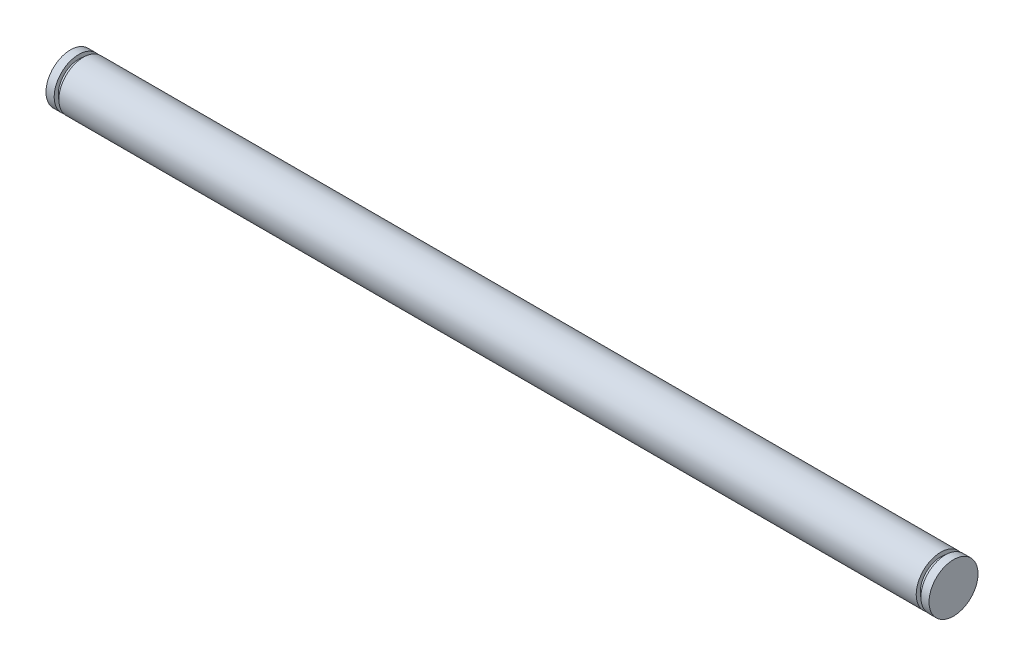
ISO-10303-21;
HEADER;
FILE_DESCRIPTION(('STEP AP214'),'2;1');
FILE_NAME('part.step','',(''),(''),'','','');
FILE_SCHEMA(('AUTOMOTIVE_DESIGN { 1 0 10303 214 1 1 1 1 }'));
ENDSEC;
DATA;
#1=APPLICATION_CONTEXT('core data for automotive mechanical design processes');
#2=APPLICATION_PROTOCOL_DEFINITION('international standard','automotive_design',2000,#1);
#3=PRODUCT_CONTEXT('',#1,'mechanical');
#4=PRODUCT('Part','Part','',(#3));
#5=PRODUCT_RELATED_PRODUCT_CATEGORY('part','',(#4));
#6=PRODUCT_DEFINITION_FORMATION('','',#4);
#7=PRODUCT_DEFINITION_CONTEXT('part definition',#1,'design');
#8=PRODUCT_DEFINITION('design','',#6,#7);
#9=PRODUCT_DEFINITION_SHAPE('','',#8);
#10=(LENGTH_UNIT() NAMED_UNIT(*) SI_UNIT(.MILLI.,.METRE.));
#11=(NAMED_UNIT(*) PLANE_ANGLE_UNIT() SI_UNIT($,.RADIAN.));
#12=(NAMED_UNIT(*) SI_UNIT($,.STERADIAN.) SOLID_ANGLE_UNIT());
#13=UNCERTAINTY_MEASURE_WITH_UNIT(LENGTH_MEASURE(1.E-05),#10,'distance_accuracy_value','');
#14=(GEOMETRIC_REPRESENTATION_CONTEXT(3) GLOBAL_UNCERTAINTY_ASSIGNED_CONTEXT((#13)) GLOBAL_UNIT_ASSIGNED_CONTEXT((#10,
#11,#12)) REPRESENTATION_CONTEXT('',''));
#15=CARTESIAN_POINT('',(0.,0.,0.));
#16=DIRECTION('',(0.,0.,1.));
#17=DIRECTION('',(1.,0.,0.));
#18=AXIS2_PLACEMENT_3D('',#15,#16,#17);
#19=CARTESIAN_POINT('',(216.3,0.,0.));
#20=DIRECTION('',(-1.,0.,0.));
#21=DIRECTION('',(0.,0.,1.));
#22=AXIS2_PLACEMENT_3D('',#19,#20,#21);
#23=CYLINDRICAL_SURFACE('',#22,6.);
#24=CARTESIAN_POINT('',(3.15000000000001,0.,0.));
#25=DIRECTION('',(1.,0.,0.));
#26=DIRECTION('',(0.,0.,-1.));
#27=AXIS2_PLACEMENT_3D('',#24,#25,#26);
#28=CIRCLE('',#27,6.);
#29=CARTESIAN_POINT('',(3.14999999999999,0.,6.));
#30=VERTEX_POINT('',#29);
#31=EDGE_CURVE('E43',#30,#30,#28,.T.);
#32=CARTESIAN_POINT('',(213.15,0.,0.));
#33=DIRECTION('',(1.,0.,0.));
#34=DIRECTION('',(0.,0.,-1.));
#35=AXIS2_PLACEMENT_3D('',#32,#33,#34);
#36=CIRCLE('',#35,6.);
#37=CARTESIAN_POINT('',(213.15,0.,6.));
#38=VERTEX_POINT('',#37);
#39=EDGE_CURVE('E34',#38,#38,#36,.T.);
#40=CARTESIAN_POINT('',(3.14999999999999,0.,6.));
#41=CARTESIAN_POINT('',(5.33749999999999,0.,6.));
#42=CARTESIAN_POINT('',(7.52499999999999,0.,6.));
#43=CARTESIAN_POINT('',(11.9,0.,6.));
#44=CARTESIAN_POINT('',(14.0875,0.,6.));
#45=CARTESIAN_POINT('',(18.4625,0.,6.));
#46=CARTESIAN_POINT('',(20.65,0.,6.));
#47=CARTESIAN_POINT('',(25.025,0.,6.));
#48=CARTESIAN_POINT('',(27.2125,0.,6.));
#49=CARTESIAN_POINT('',(31.5875,0.,6.));
#50=CARTESIAN_POINT('',(33.775,0.,6.));
#51=CARTESIAN_POINT('',(38.15,0.,6.));
#52=CARTESIAN_POINT('',(40.3375,0.,6.));
#53=CARTESIAN_POINT('',(44.7125,0.,6.));
#54=CARTESIAN_POINT('',(46.9,0.,6.));
#55=CARTESIAN_POINT('',(51.275,0.,6.));
#56=CARTESIAN_POINT('',(53.4625,0.,6.));
#57=CARTESIAN_POINT('',(57.8375,0.,6.));
#58=CARTESIAN_POINT('',(60.025,0.,6.));
#59=CARTESIAN_POINT('',(64.4,0.,6.));
#60=CARTESIAN_POINT('',(66.5875,0.,6.));
#61=CARTESIAN_POINT('',(70.9625,0.,6.));
#62=CARTESIAN_POINT('',(73.15,0.,6.));
#63=CARTESIAN_POINT('',(77.525,0.,6.));
#64=CARTESIAN_POINT('',(79.7125,0.,6.));
#65=CARTESIAN_POINT('',(84.0875,0.,6.));
#66=CARTESIAN_POINT('',(86.275,0.,6.));
#67=CARTESIAN_POINT('',(90.65,0.,6.));
#68=CARTESIAN_POINT('',(92.8375,0.,6.));
#69=CARTESIAN_POINT('',(97.2125,0.,6.));
#70=CARTESIAN_POINT('',(99.4,0.,6.));
#71=CARTESIAN_POINT('',(103.775,0.,6.));
#72=CARTESIAN_POINT('',(105.9625,0.,6.));
#73=CARTESIAN_POINT('',(110.3375,0.,6.));
#74=CARTESIAN_POINT('',(112.525,0.,6.));
#75=CARTESIAN_POINT('',(116.9,0.,6.));
#76=CARTESIAN_POINT('',(119.0875,0.,6.));
#77=CARTESIAN_POINT('',(123.4625,0.,6.));
#78=CARTESIAN_POINT('',(125.65,0.,6.));
#79=CARTESIAN_POINT('',(130.025,0.,6.));
#80=CARTESIAN_POINT('',(132.2125,0.,6.));
#81=CARTESIAN_POINT('',(136.5875,0.,6.));
#82=CARTESIAN_POINT('',(138.775,0.,6.));
#83=CARTESIAN_POINT('',(143.15,0.,6.));
#84=CARTESIAN_POINT('',(145.3375,0.,6.));
#85=CARTESIAN_POINT('',(149.7125,0.,6.));
#86=CARTESIAN_POINT('',(151.9,0.,6.));
#87=CARTESIAN_POINT('',(156.275,0.,6.));
#88=CARTESIAN_POINT('',(158.4625,0.,6.));
#89=CARTESIAN_POINT('',(162.8375,0.,6.));
#90=CARTESIAN_POINT('',(165.025,0.,6.));
#91=CARTESIAN_POINT('',(169.4,0.,6.));
#92=CARTESIAN_POINT('',(171.5875,0.,6.));
#93=CARTESIAN_POINT('',(175.9625,0.,6.));
#94=CARTESIAN_POINT('',(178.15,0.,6.));
#95=CARTESIAN_POINT('',(182.525,0.,6.));
#96=CARTESIAN_POINT('',(184.7125,0.,6.));
#97=CARTESIAN_POINT('',(189.0875,0.,6.));
#98=CARTESIAN_POINT('',(191.275,0.,6.));
#99=CARTESIAN_POINT('',(195.65,0.,6.));
#100=CARTESIAN_POINT('',(197.8375,0.,6.));
#101=CARTESIAN_POINT('',(202.2125,0.,6.));
#102=CARTESIAN_POINT('',(204.4,0.,6.));
#103=CARTESIAN_POINT('',(208.775,0.,6.));
#104=CARTESIAN_POINT('',(210.9625,0.,6.));
#105=CARTESIAN_POINT('',(213.15,0.,6.));
#106=B_SPLINE_CURVE_WITH_KNOTS('',3,(#40,#41,#42,#43,#44,#45,#46,#47,#48,#49,#50,#51,#52,#53,
#54,#55,#56,#57,#58,#59,#60,#61,#62,#63,#64,#65,#66,#67,#68,#69,#70,#71,#72,#73,#74,#75,#76,#77,
#78,#79,#80,#81,#82,#83,#84,#85,#86,#87,#88,#89,#90,#91,#92,#93,#94,#95,#96,#97,#98,#99,#100,
#101,#102,#103,#104,#105),.UNSPECIFIED.,.F.,.F.,(4,2,2,2,2,2,2,2,2,2,2,2,2,2,2,2,2,2,2,2,2,2,2,
2,2,2,2,2,2,2,2,2,4),(0.,6.5625,13.125,19.6875,26.25,32.8125,39.375,45.9375,52.5,59.0625,65.625,
72.1875,78.75,85.3125,91.875,98.4375,105.,111.5625,118.125,124.6875,131.25,137.8125,144.375,
150.9375,157.5,164.0625,170.625,177.1875,183.75,190.3125,196.875,203.4375,210.),.UNSPECIFIED.);
#107=EDGE_CURVE('BSEAM30',#30,#38,#106,.T.);
#108=ORIENTED_EDGE('',*,*,#31,.T.);
#109=ORIENTED_EDGE('',*,*,#39,.F.);
#110=ORIENTED_EDGE('',*,*,#107,.T.);
#111=ORIENTED_EDGE('',*,*,#107,.F.);
#112=EDGE_LOOP('',(#108,#110,#109,#111));
#113=FACE_BOUND('',#112,.T.);
#114=ADVANCED_FACE('F30',(#113),#23,.T.);
#115=CARTESIAN_POINT('',(3.15,0.,0.));
#116=DIRECTION('',(1.,0.,0.));
#117=DIRECTION('',(0.,0.,-1.));
#118=AXIS2_PLACEMENT_3D('',#115,#116,#117);
#119=PLANE('',#118);
#120=CARTESIAN_POINT('',(3.15,0.,0.));
#121=DIRECTION('',(1.,0.,0.));
#122=DIRECTION('',(0.,0.,-1.));
#123=AXIS2_PLACEMENT_3D('',#120,#121,#122);
#124=CIRCLE('',#123,5.);
#125=CARTESIAN_POINT('',(3.15,0.,-5.));
#126=VERTEX_POINT('',#125);
#127=EDGE_CURVE('E52',#126,#126,#124,.T.);
#128=ORIENTED_EDGE('',*,*,#127,.T.);
#129=EDGE_LOOP('',(#128));
#130=FACE_BOUND('',#129,.T.);
#131=ORIENTED_EDGE('',*,*,#31,.F.);
#132=EDGE_LOOP('',(#131));
#133=FACE_BOUND('',#132,.T.);
#134=ADVANCED_FACE('F78',(#130,#133),#119,.F.);
#135=CARTESIAN_POINT('',(2.,0.,0.));
#136=DIRECTION('',(1.,0.,0.));
#137=DIRECTION('',(0.,0.,-1.));
#138=AXIS2_PLACEMENT_3D('',#135,#136,#137);
#139=PLANE('',#138);
#140=CARTESIAN_POINT('',(2.,0.,0.));
#141=DIRECTION('',(1.,0.,0.));
#142=DIRECTION('',(0.,0.,-1.));
#143=AXIS2_PLACEMENT_3D('',#140,#141,#142);
#144=CIRCLE('',#143,5.);
#145=CARTESIAN_POINT('',(2.,0.,-5.));
#146=VERTEX_POINT('',#145);
#147=EDGE_CURVE('E46',#146,#146,#144,.T.);
#148=ORIENTED_EDGE('',*,*,#147,.F.);
#149=EDGE_LOOP('',(#148));
#150=FACE_BOUND('',#149,.T.);
#151=CARTESIAN_POINT('',(2.,0.,0.));
#152=DIRECTION('',(1.,0.,0.));
#153=DIRECTION('',(0.,0.,-1.));
#154=AXIS2_PLACEMENT_3D('',#151,#152,#153);
#155=CIRCLE('',#154,6.);
#156=CARTESIAN_POINT('',(2.,0.,6.));
#157=VERTEX_POINT('',#156);
#158=EDGE_CURVE('E49',#157,#157,#155,.T.);
#159=ORIENTED_EDGE('',*,*,#158,.T.);
#160=EDGE_LOOP('',(#159));
#161=FACE_BOUND('',#160,.T.);
#162=ADVANCED_FACE('F75',(#150,#161),#139,.T.);
#163=CARTESIAN_POINT('',(3.15,0.,0.));
#164=DIRECTION('',(-1.,0.,0.));
#165=DIRECTION('',(0.,0.,1.));
#166=AXIS2_PLACEMENT_3D('',#163,#164,#165);
#167=CYLINDRICAL_SURFACE('',#166,5.);
#168=ORIENTED_EDGE('',*,*,#127,.F.);
#169=EDGE_LOOP('',(#168));
#170=FACE_BOUND('',#169,.T.);
#171=ORIENTED_EDGE('',*,*,#147,.T.);
#172=EDGE_LOOP('',(#171));
#173=FACE_BOUND('',#172,.T.);
#174=ADVANCED_FACE('F73',(#170,#173),#167,.T.);
#175=CARTESIAN_POINT('',(0.,0.,0.));
#176=DIRECTION('',(1.,0.,0.));
#177=DIRECTION('',(0.,0.,-1.));
#178=AXIS2_PLACEMENT_3D('',#175,#176,#177);
#179=PLANE('',#178);
#180=CARTESIAN_POINT('',(0.,0.,0.));
#181=DIRECTION('',(1.,0.,0.));
#182=DIRECTION('',(0.,0.,-1.));
#183=AXIS2_PLACEMENT_3D('',#180,#181,#182);
#184=CIRCLE('',#183,6.);
#185=CARTESIAN_POINT('',(0.,0.,6.));
#186=VERTEX_POINT('',#185);
#187=EDGE_CURVE('E38',#186,#186,#184,.T.);
#188=ORIENTED_EDGE('',*,*,#187,.F.);
#189=EDGE_LOOP('',(#188));
#190=FACE_BOUND('',#189,.T.);
#191=ADVANCED_FACE('F85',(#190),#179,.F.);
#192=CARTESIAN_POINT('',(0.,0.,6.));
#193=CARTESIAN_POINT('',(0.020833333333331,0.,6.));
#194=CARTESIAN_POINT('',(0.0416666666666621,0.,6.));
#195=CARTESIAN_POINT('',(0.0833333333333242,0.,6.));
#196=CARTESIAN_POINT('',(0.104166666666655,0.,6.));
#197=CARTESIAN_POINT('',(0.145833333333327,0.,6.));
#198=CARTESIAN_POINT('',(0.166666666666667,0.,6.));
#199=CARTESIAN_POINT('',(0.208333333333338,0.,6.));
#200=CARTESIAN_POINT('',(0.229166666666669,0.,6.));
#201=CARTESIAN_POINT('',(0.270833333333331,0.,6.));
#202=CARTESIAN_POINT('',(0.291666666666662,0.,6.));
#203=CARTESIAN_POINT('',(0.333333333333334,0.,6.));
#204=CARTESIAN_POINT('',(0.354166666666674,0.,6.));
#205=CARTESIAN_POINT('',(0.395833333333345,0.,6.));
#206=CARTESIAN_POINT('',(0.416666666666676,0.,6.));
#207=CARTESIAN_POINT('',(0.458333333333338,0.,6.));
#208=CARTESIAN_POINT('',(0.479166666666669,0.,6.));
#209=CARTESIAN_POINT('',(0.520833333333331,0.,6.));
#210=CARTESIAN_POINT('',(0.541666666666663,0.,6.));
#211=CARTESIAN_POINT('',(0.583333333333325,0.,6.));
#212=CARTESIAN_POINT('',(0.604166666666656,0.,6.));
#213=CARTESIAN_POINT('',(0.645833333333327,0.,6.));
#214=CARTESIAN_POINT('',(0.666666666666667,0.,6.));
#215=CARTESIAN_POINT('',(0.708333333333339,0.,6.));
#216=CARTESIAN_POINT('',(0.72916666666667,0.,6.));
#217=CARTESIAN_POINT('',(0.770833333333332,0.,6.));
#218=CARTESIAN_POINT('',(0.791666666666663,0.,6.));
#219=CARTESIAN_POINT('',(0.833333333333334,0.,6.));
#220=CARTESIAN_POINT('',(0.854166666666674,0.,6.));
#221=CARTESIAN_POINT('',(0.895833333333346,0.,6.));
#222=CARTESIAN_POINT('',(0.916666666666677,0.,6.));
#223=CARTESIAN_POINT('',(0.958333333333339,0.,6.));
#224=CARTESIAN_POINT('',(0.97916666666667,0.,6.));
#225=CARTESIAN_POINT('',(1.02083333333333,0.,6.));
#226=CARTESIAN_POINT('',(1.04166666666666,0.,6.));
#227=CARTESIAN_POINT('',(1.08333333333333,0.,6.));
#228=CARTESIAN_POINT('',(1.10416666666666,0.,6.));
#229=CARTESIAN_POINT('',(1.14583333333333,0.,6.));
#230=CARTESIAN_POINT('',(1.16666666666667,0.,6.));
#231=CARTESIAN_POINT('',(1.20833333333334,0.,6.));
#232=CARTESIAN_POINT('',(1.22916666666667,0.,6.));
#233=CARTESIAN_POINT('',(1.27083333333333,0.,6.));
#234=CARTESIAN_POINT('',(1.29166666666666,0.,6.));
#235=CARTESIAN_POINT('',(1.33333333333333,0.,6.));
#236=CARTESIAN_POINT('',(1.35416666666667,0.,6.));
#237=CARTESIAN_POINT('',(1.39583333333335,0.,6.));
#238=CARTESIAN_POINT('',(1.41666666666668,0.,6.));
#239=CARTESIAN_POINT('',(1.45833333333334,0.,6.));
#240=CARTESIAN_POINT('',(1.47916666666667,0.,6.));
#241=CARTESIAN_POINT('',(1.52083333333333,0.,6.));
#242=CARTESIAN_POINT('',(1.54166666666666,0.,6.));
#243=CARTESIAN_POINT('',(1.58333333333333,0.,6.));
#244=CARTESIAN_POINT('',(1.60416666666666,0.,6.));
#245=CARTESIAN_POINT('',(1.64583333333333,0.,6.));
#246=CARTESIAN_POINT('',(1.66666666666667,0.,6.));
#247=CARTESIAN_POINT('',(1.70833333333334,0.,6.));
#248=CARTESIAN_POINT('',(1.72916666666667,0.,6.));
#249=CARTESIAN_POINT('',(1.77083333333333,0.,6.));
#250=CARTESIAN_POINT('',(1.79166666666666,0.,6.));
#251=CARTESIAN_POINT('',(1.83333333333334,0.,6.));
#252=CARTESIAN_POINT('',(1.85416666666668,0.,6.));
#253=CARTESIAN_POINT('',(1.89583333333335,0.,6.));
#254=CARTESIAN_POINT('',(1.91666666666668,0.,6.));
#255=CARTESIAN_POINT('',(1.95833333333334,0.,6.));
#256=CARTESIAN_POINT('',(1.97916666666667,0.,6.));
#257=CARTESIAN_POINT('',(2.,0.,6.));
#258=B_SPLINE_CURVE_WITH_KNOTS('',3,(#192,#193,#194,#195,#196,#197,#198,#199,#200,#201,#202,
#203,#204,#205,#206,#207,#208,#209,#210,#211,#212,#213,#214,#215,#216,#217,#218,#219,#220,#221,
#222,#223,#224,#225,#226,#227,#228,#229,#230,#231,#232,#233,#234,#235,#236,#237,#238,#239,#240,
#241,#242,#243,#244,#245,#246,#247,#248,#249,#250,#251,#252,#253,#254,#255,#256,#257),
.UNSPECIFIED.,.F.,.F.,(4,2,2,2,2,2,2,2,2,2,2,2,2,2,2,2,2,2,2,2,2,2,2,2,2,2,2,2,2,2,2,2,4),(0.,
0.0624999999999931,0.124999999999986,0.187500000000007,0.25,0.312499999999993,0.375000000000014,
0.437500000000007,0.5,0.562499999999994,0.624999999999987,0.687500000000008,0.750000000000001,
0.812499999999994,0.875000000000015,0.937500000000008,1.,1.06249999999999,1.12499999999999,
1.18750000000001,1.25,1.31249999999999,1.37500000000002,1.43750000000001,1.5,1.56249999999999,
1.62499999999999,1.68750000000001,1.75,1.81249999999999,1.87500000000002,1.93750000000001,2.),.UNSPECIFIED.);
#259=EDGE_CURVE('BSEAM82',#186,#157,#258,.T.);
#260=ORIENTED_EDGE('',*,*,#187,.T.);
#261=ORIENTED_EDGE('',*,*,#158,.F.);
#262=ORIENTED_EDGE('',*,*,#259,.T.);
#263=ORIENTED_EDGE('',*,*,#259,.F.);
#264=EDGE_LOOP('',(#260,#262,#261,#263));
#265=FACE_BOUND('',#264,.T.);
#266=ADVANCED_FACE('F82',(#265),#23,.T.);
#267=CARTESIAN_POINT('',(213.15,0.,0.));
#268=DIRECTION('',(1.,0.,0.));
#269=DIRECTION('',(0.,0.,-1.));
#270=AXIS2_PLACEMENT_3D('',#267,#268,#269);
#271=PLANE('',#270);
#272=CARTESIAN_POINT('',(213.15,0.,0.));
#273=DIRECTION('',(1.,0.,0.));
#274=DIRECTION('',(0.,0.,-1.));
#275=AXIS2_PLACEMENT_3D('',#272,#273,#274);
#276=CIRCLE('',#275,5.);
#277=CARTESIAN_POINT('',(213.15,0.,-5.));
#278=VERTEX_POINT('',#277);
#279=EDGE_CURVE('E56',#278,#278,#276,.T.);
#280=ORIENTED_EDGE('',*,*,#279,.F.);
#281=EDGE_LOOP('',(#280));
#282=FACE_BOUND('',#281,.T.);
#283=ORIENTED_EDGE('',*,*,#39,.T.);
#284=EDGE_LOOP('',(#283));
#285=FACE_BOUND('',#284,.T.);
#286=ADVANCED_FACE('F84',(#282,#285),#271,.T.);
#287=CARTESIAN_POINT('',(214.3,0.,0.));
#288=DIRECTION('',(1.,0.,0.));
#289=DIRECTION('',(0.,0.,-1.));
#290=AXIS2_PLACEMENT_3D('',#287,#288,#289);
#291=PLANE('',#290);
#292=CARTESIAN_POINT('',(214.3,0.,0.));
#293=DIRECTION('',(1.,0.,0.));
#294=DIRECTION('',(0.,0.,-1.));
#295=AXIS2_PLACEMENT_3D('',#292,#293,#294);
#296=CIRCLE('',#295,5.);
#297=CARTESIAN_POINT('',(214.3,0.,-5.));
#298=VERTEX_POINT('',#297);
#299=EDGE_CURVE('E61',#298,#298,#296,.T.);
#300=ORIENTED_EDGE('',*,*,#299,.T.);
#301=EDGE_LOOP('',(#300));
#302=FACE_BOUND('',#301,.T.);
#303=CARTESIAN_POINT('',(214.3,0.,0.));
#304=DIRECTION('',(1.,0.,0.));
#305=DIRECTION('',(0.,0.,-1.));
#306=AXIS2_PLACEMENT_3D('',#303,#304,#305);
#307=CIRCLE('',#306,6.);
#308=CARTESIAN_POINT('',(214.3,0.,6.));
#309=VERTEX_POINT('',#308);
#310=EDGE_CURVE('E54',#309,#309,#307,.T.);
#311=ORIENTED_EDGE('',*,*,#310,.F.);
#312=EDGE_LOOP('',(#311));
#313=FACE_BOUND('',#312,.T.);
#314=ADVANCED_FACE('F91',(#302,#313),#291,.F.);
#315=CARTESIAN_POINT('',(213.15,0.,0.));
#316=DIRECTION('',(1.,0.,0.));
#317=DIRECTION('',(0.,0.,-1.));
#318=AXIS2_PLACEMENT_3D('',#315,#316,#317);
#319=CYLINDRICAL_SURFACE('',#318,5.);
#320=ORIENTED_EDGE('',*,*,#279,.T.);
#321=EDGE_LOOP('',(#320));
#322=FACE_BOUND('',#321,.T.);
#323=ORIENTED_EDGE('',*,*,#299,.F.);
#324=EDGE_LOOP('',(#323));
#325=FACE_BOUND('',#324,.T.);
#326=ADVANCED_FACE('F114',(#322,#325),#319,.T.);
#327=CARTESIAN_POINT('',(216.3,0.,0.));
#328=DIRECTION('',(1.,0.,0.));
#329=DIRECTION('',(0.,0.,-1.));
#330=AXIS2_PLACEMENT_3D('',#327,#328,#329);
#331=PLANE('',#330);
#332=CARTESIAN_POINT('',(216.3,0.,0.));
#333=DIRECTION('',(1.,0.,0.));
#334=DIRECTION('',(0.,0.,-1.));
#335=AXIS2_PLACEMENT_3D('',#332,#333,#334);
#336=CIRCLE('',#335,6.);
#337=CARTESIAN_POINT('',(216.3,0.,6.));
#338=VERTEX_POINT('',#337);
#339=EDGE_CURVE('E11',#338,#338,#336,.T.);
#340=ORIENTED_EDGE('',*,*,#339,.T.);
#341=EDGE_LOOP('',(#340));
#342=FACE_BOUND('',#341,.T.);
#343=ADVANCED_FACE('F96',(#342),#331,.T.);
#344=CARTESIAN_POINT('',(214.3,0.,6.));
#345=CARTESIAN_POINT('',(214.320833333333,0.,6.));
#346=CARTESIAN_POINT('',(214.341666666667,0.,6.));
#347=CARTESIAN_POINT('',(214.383333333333,0.,6.));
#348=CARTESIAN_POINT('',(214.404166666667,0.,6.));
#349=CARTESIAN_POINT('',(214.445833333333,0.,6.));
#350=CARTESIAN_POINT('',(214.466666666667,0.,6.));
#351=CARTESIAN_POINT('',(214.508333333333,0.,6.));
#352=CARTESIAN_POINT('',(214.529166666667,0.,6.));
#353=CARTESIAN_POINT('',(214.570833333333,0.,6.));
#354=CARTESIAN_POINT('',(214.591666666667,0.,6.));
#355=CARTESIAN_POINT('',(214.633333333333,0.,6.));
#356=CARTESIAN_POINT('',(214.654166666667,0.,6.));
#357=CARTESIAN_POINT('',(214.695833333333,0.,6.));
#358=CARTESIAN_POINT('',(214.716666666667,0.,6.));
#359=CARTESIAN_POINT('',(214.758333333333,0.,6.));
#360=CARTESIAN_POINT('',(214.779166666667,0.,6.));
#361=CARTESIAN_POINT('',(214.820833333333,0.,6.));
#362=CARTESIAN_POINT('',(214.841666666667,0.,6.));
#363=CARTESIAN_POINT('',(214.883333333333,0.,6.));
#364=CARTESIAN_POINT('',(214.904166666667,0.,6.));
#365=CARTESIAN_POINT('',(214.945833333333,0.,6.));
#366=CARTESIAN_POINT('',(214.966666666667,0.,6.));
#367=CARTESIAN_POINT('',(215.008333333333,0.,6.));
#368=CARTESIAN_POINT('',(215.029166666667,0.,6.));
#369=CARTESIAN_POINT('',(215.070833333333,0.,6.));
#370=CARTESIAN_POINT('',(215.091666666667,0.,6.));
#371=CARTESIAN_POINT('',(215.133333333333,0.,6.));
#372=CARTESIAN_POINT('',(215.154166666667,0.,6.));
#373=CARTESIAN_POINT('',(215.195833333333,0.,6.));
#374=CARTESIAN_POINT('',(215.216666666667,0.,6.));
#375=CARTESIAN_POINT('',(215.258333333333,0.,6.));
#376=CARTESIAN_POINT('',(215.279166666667,0.,6.));
#377=CARTESIAN_POINT('',(215.320833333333,0.,6.));
#378=CARTESIAN_POINT('',(215.341666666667,0.,6.));
#379=CARTESIAN_POINT('',(215.383333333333,0.,6.));
#380=CARTESIAN_POINT('',(215.404166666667,0.,6.));
#381=CARTESIAN_POINT('',(215.445833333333,0.,6.));
#382=CARTESIAN_POINT('',(215.466666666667,0.,6.));
#383=CARTESIAN_POINT('',(215.508333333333,0.,6.));
#384=CARTESIAN_POINT('',(215.529166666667,0.,6.));
#385=CARTESIAN_POINT('',(215.570833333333,0.,6.));
#386=CARTESIAN_POINT('',(215.591666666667,0.,6.));
#387=CARTESIAN_POINT('',(215.633333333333,0.,6.));
#388=CARTESIAN_POINT('',(215.654166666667,0.,6.));
#389=CARTESIAN_POINT('',(215.695833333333,0.,6.));
#390=CARTESIAN_POINT('',(215.716666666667,0.,6.));
#391=CARTESIAN_POINT('',(215.758333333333,0.,6.));
#392=CARTESIAN_POINT('',(215.779166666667,0.,6.));
#393=CARTESIAN_POINT('',(215.820833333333,0.,6.));
#394=CARTESIAN_POINT('',(215.841666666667,0.,6.));
#395=CARTESIAN_POINT('',(215.883333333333,0.,6.));
#396=CARTESIAN_POINT('',(215.904166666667,0.,6.));
#397=CARTESIAN_POINT('',(215.945833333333,0.,6.));
#398=CARTESIAN_POINT('',(215.966666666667,0.,6.));
#399=CARTESIAN_POINT('',(216.008333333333,0.,6.));
#400=CARTESIAN_POINT('',(216.029166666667,0.,6.));
#401=CARTESIAN_POINT('',(216.070833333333,0.,6.));
#402=CARTESIAN_POINT('',(216.091666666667,0.,6.));
#403=CARTESIAN_POINT('',(216.133333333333,0.,6.));
#404=CARTESIAN_POINT('',(216.154166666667,0.,6.));
#405=CARTESIAN_POINT('',(216.195833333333,0.,6.));
#406=CARTESIAN_POINT('',(216.216666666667,0.,6.));
#407=CARTESIAN_POINT('',(216.258333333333,0.,6.));
#408=CARTESIAN_POINT('',(216.279166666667,0.,6.));
#409=CARTESIAN_POINT('',(216.3,0.,6.));
#410=B_SPLINE_CURVE_WITH_KNOTS('',3,(#344,#345,#346,#347,#348,#349,#350,#351,#352,#353,#354,
#355,#356,#357,#358,#359,#360,#361,#362,#363,#364,#365,#366,#367,#368,#369,#370,#371,#372,#373,
#374,#375,#376,#377,#378,#379,#380,#381,#382,#383,#384,#385,#386,#387,#388,#389,#390,#391,#392,
#393,#394,#395,#396,#397,#398,#399,#400,#401,#402,#403,#404,#405,#406,#407,#408,#409),
.UNSPECIFIED.,.F.,.F.,(4,2,2,2,2,2,2,2,2,2,2,2,2,2,2,2,2,2,2,2,2,2,2,2,2,2,2,2,2,2,2,2,4),(0.,
0.0624999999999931,0.124999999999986,0.187499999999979,0.25,0.312499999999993,0.374999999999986,
0.43749999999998,0.5,0.562499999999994,0.624999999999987,0.68749999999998,0.750000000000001,
0.812499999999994,0.874999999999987,0.93749999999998,1.,1.06249999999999,1.12499999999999,
1.18749999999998,1.25,1.31249999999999,1.37499999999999,1.43749999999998,1.5,1.56249999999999,
1.62499999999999,1.68749999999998,1.75,1.81249999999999,1.87499999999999,1.93749999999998,2.),.UNSPECIFIED.);
#411=EDGE_CURVE('BSEAM32',#309,#338,#410,.T.);
#412=ORIENTED_EDGE('',*,*,#310,.T.);
#413=ORIENTED_EDGE('',*,*,#339,.F.);
#414=ORIENTED_EDGE('',*,*,#411,.T.);
#415=ORIENTED_EDGE('',*,*,#411,.F.);
#416=EDGE_LOOP('',(#412,#414,#413,#415));
#417=FACE_BOUND('',#416,.T.);
#418=ADVANCED_FACE('F32',(#417),#23,.T.);
#419=CLOSED_SHELL('',(#114,#134,#162,#174,#191,#266,#286,#314,#326,#343,#418));
#420=MANIFOLD_SOLID_BREP('B2',#419);
#421=ADVANCED_BREP_SHAPE_REPRESENTATION('',(#18,#420),#14);
#422=SHAPE_DEFINITION_REPRESENTATION(#9,#421);
ENDSEC;
END-ISO-10303-21;
